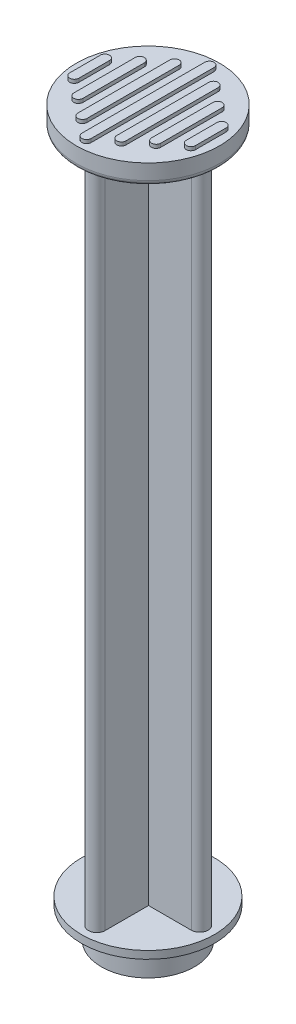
from build123d import *

# Parameters (mm, degrees)
SKETCH1_R           = 4.55
BOSS_EXTRUDE1_DEPTH = 1.83
SKETCH3_R           = 2.47
BOSS_EXTRUDE2_DEPTH = 1.13
SKETCH4_R           = 6.5
BOSS_EXTRUDE3_DEPTH = 0.75
BOSS_EXTRUDE4_DEPTH = 65
SKETCH6_R           = 7
BOSS_EXTRUDE5_DEPTH = 2
FILLET4_R           = 0.5
BOSS_EXTRUDE6_DEPTH = 0.35


with BuildPart() as part:
    # Sketch1 → Boss-Extrude1 (new body)
    with BuildSketch(Plane(origin=(0, 0, 0), x_dir=(1, 0, 0), z_dir=(0, 1, 0))):
        with Locations(Location((0, 0, 0), (0, 0, 270))):
            Circle(SKETCH1_R)
    extrude(amount=BOSS_EXTRUDE1_DEPTH)

    # Sketch3 → Boss-Extrude2 (add)
    with BuildSketch(Plane(origin=(0, 1.83, 0), x_dir=(1, 0, 0), z_dir=(0, 1, 0))):
        with Locations(Location((0, 0, 0), (0, 0, 270))):
            Circle(SKETCH3_R)
    extrude(amount=BOSS_EXTRUDE2_DEPTH)

    # Sketch4 → Boss-Extrude3 (add)
    with BuildSketch(Plane(origin=(0, 2.96, 0), x_dir=(1, 0, 0), z_dir=(0, 1, 0))):
        with Locations(Location((0, 0, 0), (0, 0, 270))):
            Circle(SKETCH4_R)
    extrude(amount=BOSS_EXTRUDE3_DEPTH)

    # Sketch5 → Boss-Extrude4 (add)
    with BuildSketch(Plane(origin=(0, 3.71, 0), x_dir=(1, 0, 0), z_dir=(0, 1, 0))):
        with BuildLine():
            Line((0.819346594, 5), (0.819346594, 0.87685272))
            Line((0.819346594, 0.87685272), (5, 0.87685272))
            ThreePointArc((5, 0.87685272), (5.82, 0.05685272), (5, -0.76314728))
            Line((5, -0.76314728), (0.819346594, -0.76314728))
            Line((0.819346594, -0.76314728), (0.819346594, -5))
            ThreePointArc((0.819346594, -5), (0, -5.819346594), (-0.819346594, -5))
            Line((-0.819346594, -5), (-0.819346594, -0.76314728))
            Line((-0.819346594, -0.76314728), (-5, -0.76314728))
            ThreePointArc((-5, -0.76314728), (-5.82, 0.05685272), (-5, 0.87685272))
            Line((-5, 0.87685272), (-0.819346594, 0.87685272))
            Line((-0.819346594, 0.87685272), (-0.819346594, 5))
            ThreePointArc((-0.819346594, 5), (0, 5.819346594), (0.819346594, 5))
        make_face()
    extrude(amount=BOSS_EXTRUDE4_DEPTH)

    # Sketch6 → Boss-Extrude5 (add)
    with BuildSketch(Plane(origin=(0, 68.71, 0), x_dir=(1, 0, 0), z_dir=(0, 1, 0))):
        with Locations(Location((0, 0, 0), (0, 0, 270))):
            Circle(SKETCH6_R)
    extrude(amount=BOSS_EXTRUDE5_DEPTH)

    # Fillet4
    fillet4_edges = [part.edges().sort_by_distance(p)[0] for p in [
        (0, 68.71, -7),
    ]]
    fillet(fillet4_edges, radius=FILLET4_R)

    # Sketch7 → Boss-Extrude6 (add)
    with BuildSketch(Plane(origin=(0, 70.71, 0), x_dir=(1, 0, 0), z_dir=(0, 1, 0))):
        with BuildLine():
            Line((-0.45, -6), (-0.45, 6))
            ThreePointArc((-0.45, 6), (0, 6.45), (0.45, 6))
            Line((0.45, 6), (0.45, -6))
            ThreePointArc((0.45, -6), (0, -6.45), (-0.45, -6))
        make_face()
        with BuildLine():
            Line((2.35, 4.5), (2.35, -4.5))
            ThreePointArc((2.35, -4.5), (1.9, -4.95), (1.45, -4.5))
            Line((1.45, -4.5), (1.45, 4.5))
            ThreePointArc((1.45, 4.5), (1.9, 4.95), (2.35, 4.5))
        make_face()
        with BuildLine():
            Line((6.15, 1.5), (6.15, -1.5))
            ThreePointArc((6.15, -1.5), (5.7, -1.95), (5.25, -1.5))
            Line((5.25, -1.5), (5.25, 1.5))
            ThreePointArc((5.25, 1.5), (5.7, 1.95), (6.15, 1.5))
        make_face()
        with BuildLine():
            Line((4.25, 3), (4.25, -3))
            ThreePointArc((4.25, -3), (3.8, -3.45), (3.35, -3))
            Line((3.35, -3), (3.35, 3))
            ThreePointArc((3.35, 3), (3.8, 3.45), (4.25, 3))
        make_face()
        with BuildLine():
            Line((-6.15, 1.5), (-6.15, -1.5))
            ThreePointArc((-6.15, -1.5), (-5.7, -1.95), (-5.25, -1.5))
            Line((-5.25, -1.5), (-5.25, 1.5))
            ThreePointArc((-5.25, 1.5), (-5.7, 1.95), (-6.15, 1.5))
        make_face()
        with BuildLine():
            Line((-4.25, 3), (-4.25, -3))
            ThreePointArc((-4.25, -3), (-3.8, -3.45), (-3.35, -3))
            Line((-3.35, -3), (-3.35, 3))
            ThreePointArc((-3.35, 3), (-3.8, 3.45), (-4.25, 3))
        make_face()
        with BuildLine():
            Line((-2.35, 4.5), (-2.35, -4.5))
            ThreePointArc((-2.35, -4.5), (-1.9, -4.95), (-1.45, -4.5))
            Line((-1.45, -4.5), (-1.45, 4.5))
            ThreePointArc((-1.45, 4.5), (-1.9, 4.95), (-2.35, 4.5))
        make_face()
    extrude(amount=BOSS_EXTRUDE6_DEPTH)


solid = part.part
